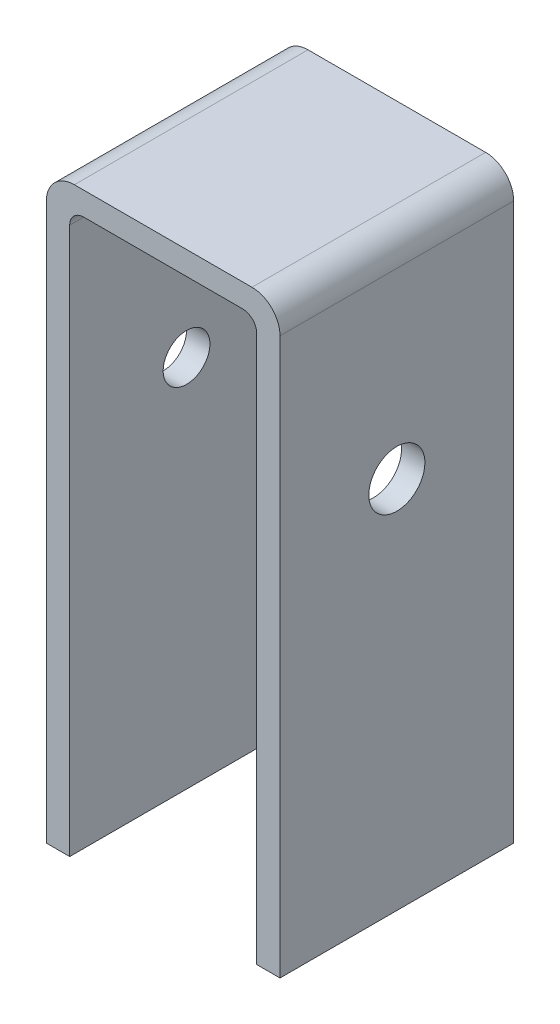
ISO-10303-21;
HEADER;
FILE_DESCRIPTION(('STEP AP214'),'2;1');
FILE_NAME('part.step','',(''),(''),'','','');
FILE_SCHEMA(('AUTOMOTIVE_DESIGN { 1 0 10303 214 1 1 1 1 }'));
ENDSEC;
DATA;
#1=APPLICATION_CONTEXT('core data for automotive mechanical design processes');
#2=APPLICATION_PROTOCOL_DEFINITION('international standard','automotive_design',2000,#1);
#3=PRODUCT_CONTEXT('',#1,'mechanical');
#4=PRODUCT('Part','Part','',(#3));
#5=PRODUCT_RELATED_PRODUCT_CATEGORY('part','',(#4));
#6=PRODUCT_DEFINITION_FORMATION('','',#4);
#7=PRODUCT_DEFINITION_CONTEXT('part definition',#1,'design');
#8=PRODUCT_DEFINITION('design','',#6,#7);
#9=PRODUCT_DEFINITION_SHAPE('','',#8);
#10=(LENGTH_UNIT() NAMED_UNIT(*) SI_UNIT(.MILLI.,.METRE.));
#11=(NAMED_UNIT(*) PLANE_ANGLE_UNIT() SI_UNIT($,.RADIAN.));
#12=(NAMED_UNIT(*) SI_UNIT($,.STERADIAN.) SOLID_ANGLE_UNIT());
#13=UNCERTAINTY_MEASURE_WITH_UNIT(LENGTH_MEASURE(1.E-05),#10,'distance_accuracy_value','');
#14=(GEOMETRIC_REPRESENTATION_CONTEXT(3) GLOBAL_UNCERTAINTY_ASSIGNED_CONTEXT((#13)) GLOBAL_UNIT_ASSIGNED_CONTEXT((#10,
#11,#12)) REPRESENTATION_CONTEXT('',''));
#15=CARTESIAN_POINT('',(0.,0.,0.));
#16=DIRECTION('',(0.,0.,1.));
#17=DIRECTION('',(1.,0.,0.));
#18=AXIS2_PLACEMENT_3D('',#15,#16,#17);
#19=CARTESIAN_POINT('',(0.,119.,50.));
#20=DIRECTION('',(1.,0.,0.));
#21=DIRECTION('',(0.,1.,0.));
#22=AXIS2_PLACEMENT_3D('',#19,#20,#21);
#23=PLANE('',#22);
#24=CARTESIAN_POINT('',(0.,80.,25.));
#25=DIRECTION('',(1.,0.,0.));
#26=DIRECTION('',(0.,1.,0.));
#27=AXIS2_PLACEMENT_3D('',#24,#25,#26);
#28=CIRCLE('',#27,4.99999999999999);
#29=CARTESIAN_POINT('',(0.,85.,25.));
#30=VERTEX_POINT('',#29);
#31=EDGE_CURVE('E265',#30,#30,#28,.T.);
#32=ORIENTED_EDGE('',*,*,#31,.T.);
#33=EDGE_LOOP('',(#32));
#34=FACE_BOUND('',#33,.T.);
#35=DIRECTION('',(0.,-1.,0.));
#36=VECTOR('',#35,1.);
#37=CARTESIAN_POINT('',(0.,119.,0.));
#38=LINE('',#37,#36);
#39=CARTESIAN_POINT('',(0.,119.,0.));
#40=VERTEX_POINT('',#39);
#41=CARTESIAN_POINT('',(0.,0.,0.));
#42=VERTEX_POINT('',#41);
#43=EDGE_CURVE('E116',#40,#42,#38,.T.);
#44=ORIENTED_EDGE('',*,*,#43,.T.);
#45=DIRECTION('',(0.,0.,-1.));
#46=VECTOR('',#45,1.);
#47=CARTESIAN_POINT('',(0.,0.,50.));
#48=LINE('',#47,#46);
#49=CARTESIAN_POINT('',(0.,0.,50.));
#50=VERTEX_POINT('',#49);
#51=EDGE_CURVE('E11',#50,#42,#48,.T.);
#52=ORIENTED_EDGE('',*,*,#51,.F.);
#53=DIRECTION('',(0.,-1.,0.));
#54=VECTOR('',#53,1.);
#55=CARTESIAN_POINT('',(0.,119.,50.));
#56=LINE('',#55,#54);
#57=CARTESIAN_POINT('',(0.,119.,50.));
#58=VERTEX_POINT('',#57);
#59=EDGE_CURVE('E156',#58,#50,#56,.T.);
#60=ORIENTED_EDGE('',*,*,#59,.F.);
#61=DIRECTION('',(0.,0.,-1.));
#62=VECTOR('',#61,1.);
#63=CARTESIAN_POINT('',(0.,119.,50.));
#64=LINE('',#63,#62);
#65=EDGE_CURVE('E129',#58,#40,#64,.T.);
#66=ORIENTED_EDGE('',*,*,#65,.T.);
#67=EDGE_LOOP('',(#44,#52,#60,#66));
#68=FACE_BOUND('',#67,.T.);
#69=ADVANCED_FACE('F24',(#34,#68),#23,.F.);
#70=CARTESIAN_POINT('',(0.,0.,50.));
#71=DIRECTION('',(0.,1.,0.));
#72=DIRECTION('',(0.,0.,1.));
#73=AXIS2_PLACEMENT_3D('',#70,#71,#72);
#74=PLANE('',#73);
#75=DIRECTION('',(1.,0.,0.));
#76=VECTOR('',#75,1.);
#77=CARTESIAN_POINT('',(0.,0.,0.));
#78=LINE('',#77,#76);
#79=CARTESIAN_POINT('',(5.,0.,0.));
#80=VERTEX_POINT('',#79);
#81=EDGE_CURVE('E112',#42,#80,#78,.T.);
#82=ORIENTED_EDGE('',*,*,#81,.T.);
#83=DIRECTION('',(0.,0.,-1.));
#84=VECTOR('',#83,1.);
#85=CARTESIAN_POINT('',(5.,0.,50.));
#86=LINE('',#85,#84);
#87=CARTESIAN_POINT('',(5.,0.,50.));
#88=VERTEX_POINT('',#87);
#89=EDGE_CURVE('E31',#88,#80,#86,.T.);
#90=ORIENTED_EDGE('',*,*,#89,.F.);
#91=DIRECTION('',(1.,0.,0.));
#92=VECTOR('',#91,1.);
#93=CARTESIAN_POINT('',(0.,0.,50.));
#94=LINE('',#93,#92);
#95=EDGE_CURVE('E125',#50,#88,#94,.T.);
#96=ORIENTED_EDGE('',*,*,#95,.F.);
#97=ORIENTED_EDGE('',*,*,#51,.T.);
#98=EDGE_LOOP('',(#82,#90,#96,#97));
#99=FACE_BOUND('',#98,.T.);
#100=ADVANCED_FACE('F124',(#99),#74,.F.);
#101=CARTESIAN_POINT('',(5.,0.,50.));
#102=DIRECTION('',(-1.,0.,0.));
#103=DIRECTION('',(0.,0.,1.));
#104=AXIS2_PLACEMENT_3D('',#101,#102,#103);
#105=PLANE('',#104);
#106=CARTESIAN_POINT('',(5.,80.,25.));
#107=DIRECTION('',(1.,0.,0.));
#108=DIRECTION('',(0.,0.,-1.));
#109=AXIS2_PLACEMENT_3D('',#106,#107,#108);
#110=CIRCLE('',#109,4.99999999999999);
#111=CARTESIAN_POINT('',(5.,80.,20.));
#112=VERTEX_POINT('',#111);
#113=EDGE_CURVE('E267',#112,#112,#110,.T.);
#114=ORIENTED_EDGE('',*,*,#113,.F.);
#115=EDGE_LOOP('',(#114));
#116=FACE_BOUND('',#115,.T.);
#117=DIRECTION('',(0.,1.,0.));
#118=VECTOR('',#117,1.);
#119=CARTESIAN_POINT('',(5.,0.,0.));
#120=LINE('',#119,#118);
#121=CARTESIAN_POINT('',(5.,117.,0.));
#122=VERTEX_POINT('',#121);
#123=EDGE_CURVE('E118',#80,#122,#120,.T.);
#124=ORIENTED_EDGE('',*,*,#123,.T.);
#125=DIRECTION('',(0.,0.,-1.));
#126=VECTOR('',#125,1.);
#127=CARTESIAN_POINT('',(5.,117.,50.));
#128=LINE('',#127,#126);
#129=CARTESIAN_POINT('',(5.,117.,50.));
#130=VERTEX_POINT('',#129);
#131=EDGE_CURVE('E202',#130,#122,#128,.T.);
#132=ORIENTED_EDGE('',*,*,#131,.F.);
#133=DIRECTION('',(0.,1.,0.));
#134=VECTOR('',#133,1.);
#135=CARTESIAN_POINT('',(5.,0.,50.));
#136=LINE('',#135,#134);
#137=EDGE_CURVE('E159',#88,#130,#136,.T.);
#138=ORIENTED_EDGE('',*,*,#137,.F.);
#139=ORIENTED_EDGE('',*,*,#89,.T.);
#140=EDGE_LOOP('',(#124,#132,#138,#139));
#141=FACE_BOUND('',#140,.T.);
#142=ADVANCED_FACE('F206',(#116,#141),#105,.F.);
#143=CARTESIAN_POINT('',(8.,117.,50.));
#144=DIRECTION('',(0.,0.,-1.));
#145=DIRECTION('',(-1.,0.,0.));
#146=AXIS2_PLACEMENT_3D('',#143,#144,#145);
#147=CYLINDRICAL_SURFACE('',#146,3.);
#148=CARTESIAN_POINT('',(8.,117.,0.));
#149=DIRECTION('',(0.,0.,-1.));
#150=DIRECTION('',(1.,0.,0.));
#151=AXIS2_PLACEMENT_3D('',#148,#149,#150);
#152=CIRCLE('',#151,3.);
#153=CARTESIAN_POINT('',(8.00000000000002,120.,0.));
#154=VERTEX_POINT('',#153);
#155=EDGE_CURVE('E138',#122,#154,#152,.T.);
#156=ORIENTED_EDGE('',*,*,#155,.T.);
#157=DIRECTION('',(0.,0.,-1.));
#158=VECTOR('',#157,1.);
#159=CARTESIAN_POINT('',(8.00000000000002,120.,50.));
#160=LINE('',#159,#158);
#161=CARTESIAN_POINT('',(8.00000000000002,120.,50.));
#162=VERTEX_POINT('',#161);
#163=EDGE_CURVE('E199',#162,#154,#160,.T.);
#164=ORIENTED_EDGE('',*,*,#163,.F.);
#165=CARTESIAN_POINT('',(8.,117.,50.));
#166=DIRECTION('',(0.,0.,-1.));
#167=DIRECTION('',(1.,0.,0.));
#168=AXIS2_PLACEMENT_3D('',#165,#166,#167);
#169=CIRCLE('',#168,3.);
#170=EDGE_CURVE('E161',#130,#162,#169,.T.);
#171=ORIENTED_EDGE('',*,*,#170,.F.);
#172=ORIENTED_EDGE('',*,*,#131,.T.);
#173=EDGE_LOOP('',(#156,#164,#171,#172));
#174=FACE_BOUND('',#173,.T.);
#175=ADVANCED_FACE('F214',(#174),#147,.F.);
#176=CARTESIAN_POINT('',(8.00000000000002,120.,50.));
#177=DIRECTION('',(0.,1.,0.));
#178=DIRECTION('',(0.,0.,1.));
#179=AXIS2_PLACEMENT_3D('',#176,#177,#178);
#180=PLANE('',#179);
#181=DIRECTION('',(1.,0.,0.));
#182=VECTOR('',#181,1.);
#183=CARTESIAN_POINT('',(8.00000000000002,120.,0.));
#184=LINE('',#183,#182);
#185=CARTESIAN_POINT('',(42.,120.,0.));
#186=VERTEX_POINT('',#185);
#187=EDGE_CURVE('E140',#154,#186,#184,.T.);
#188=ORIENTED_EDGE('',*,*,#187,.T.);
#189=DIRECTION('',(0.,0.,-1.));
#190=VECTOR('',#189,1.);
#191=CARTESIAN_POINT('',(42.,120.,50.));
#192=LINE('',#191,#190);
#193=CARTESIAN_POINT('',(42.,120.,50.));
#194=VERTEX_POINT('',#193);
#195=EDGE_CURVE('E196',#194,#186,#192,.T.);
#196=ORIENTED_EDGE('',*,*,#195,.F.);
#197=DIRECTION('',(1.,0.,0.));
#198=VECTOR('',#197,1.);
#199=CARTESIAN_POINT('',(8.00000000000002,120.,50.));
#200=LINE('',#199,#198);
#201=EDGE_CURVE('E163',#162,#194,#200,.T.);
#202=ORIENTED_EDGE('',*,*,#201,.F.);
#203=ORIENTED_EDGE('',*,*,#163,.T.);
#204=EDGE_LOOP('',(#188,#196,#202,#203));
#205=FACE_BOUND('',#204,.T.);
#206=ADVANCED_FACE('F217',(#205),#180,.F.);
#207=CARTESIAN_POINT('',(42.,117.,50.));
#208=DIRECTION('',(0.,0.,-1.));
#209=DIRECTION('',(-1.,0.,0.));
#210=AXIS2_PLACEMENT_3D('',#207,#208,#209);
#211=CYLINDRICAL_SURFACE('',#210,3.);
#212=CARTESIAN_POINT('',(42.,117.,0.));
#213=DIRECTION('',(0.,0.,-1.));
#214=DIRECTION('',(1.,0.,0.));
#215=AXIS2_PLACEMENT_3D('',#212,#213,#214);
#216=CIRCLE('',#215,3.);
#217=CARTESIAN_POINT('',(45.,117.,0.));
#218=VERTEX_POINT('',#217);
#219=EDGE_CURVE('E142',#186,#218,#216,.T.);
#220=ORIENTED_EDGE('',*,*,#219,.T.);
#221=DIRECTION('',(0.,0.,-1.));
#222=VECTOR('',#221,1.);
#223=CARTESIAN_POINT('',(45.,117.,50.));
#224=LINE('',#223,#222);
#225=CARTESIAN_POINT('',(45.,117.,50.));
#226=VERTEX_POINT('',#225);
#227=EDGE_CURVE('E193',#226,#218,#224,.T.);
#228=ORIENTED_EDGE('',*,*,#227,.F.);
#229=CARTESIAN_POINT('',(42.,117.,50.));
#230=DIRECTION('',(0.,0.,-1.));
#231=DIRECTION('',(1.,0.,0.));
#232=AXIS2_PLACEMENT_3D('',#229,#230,#231);
#233=CIRCLE('',#232,3.);
#234=EDGE_CURVE('E165',#194,#226,#233,.T.);
#235=ORIENTED_EDGE('',*,*,#234,.F.);
#236=ORIENTED_EDGE('',*,*,#195,.T.);
#237=EDGE_LOOP('',(#220,#228,#235,#236));
#238=FACE_BOUND('',#237,.T.);
#239=ADVANCED_FACE('F222',(#238),#211,.F.);
#240=CARTESIAN_POINT('',(45.,117.,50.));
#241=DIRECTION('',(1.,0.,0.));
#242=DIRECTION('',(0.,1.,0.));
#243=AXIS2_PLACEMENT_3D('',#240,#241,#242);
#244=PLANE('',#243);
#245=CARTESIAN_POINT('',(45.,80.,25.));
#246=DIRECTION('',(1.,0.,0.));
#247=DIRECTION('',(0.,1.,0.));
#248=AXIS2_PLACEMENT_3D('',#245,#246,#247);
#249=CIRCLE('',#248,6.);
#250=CARTESIAN_POINT('',(45.,86.,25.));
#251=VERTEX_POINT('',#250);
#252=EDGE_CURVE('E130',#251,#251,#249,.T.);
#253=ORIENTED_EDGE('',*,*,#252,.T.);
#254=EDGE_LOOP('',(#253));
#255=FACE_BOUND('',#254,.T.);
#256=DIRECTION('',(0.,-1.,0.));
#257=VECTOR('',#256,1.);
#258=CARTESIAN_POINT('',(45.,117.,0.));
#259=LINE('',#258,#257);
#260=CARTESIAN_POINT('',(45.,0.,0.));
#261=VERTEX_POINT('',#260);
#262=EDGE_CURVE('E144',#218,#261,#259,.T.);
#263=ORIENTED_EDGE('',*,*,#262,.T.);
#264=DIRECTION('',(0.,0.,-1.));
#265=VECTOR('',#264,1.);
#266=CARTESIAN_POINT('',(45.,0.,50.));
#267=LINE('',#266,#265);
#268=CARTESIAN_POINT('',(45.,0.,50.));
#269=VERTEX_POINT('',#268);
#270=EDGE_CURVE('E190',#269,#261,#267,.T.);
#271=ORIENTED_EDGE('',*,*,#270,.F.);
#272=DIRECTION('',(0.,-1.,0.));
#273=VECTOR('',#272,1.);
#274=CARTESIAN_POINT('',(45.,117.,50.));
#275=LINE('',#274,#273);
#276=EDGE_CURVE('E167',#226,#269,#275,.T.);
#277=ORIENTED_EDGE('',*,*,#276,.F.);
#278=ORIENTED_EDGE('',*,*,#227,.T.);
#279=EDGE_LOOP('',(#263,#271,#277,#278));
#280=FACE_BOUND('',#279,.T.);
#281=ADVANCED_FACE('F228',(#255,#280),#244,.F.);
#282=CARTESIAN_POINT('',(45.,0.,50.));
#283=DIRECTION('',(0.,1.,0.));
#284=DIRECTION('',(-1.,0.,0.));
#285=AXIS2_PLACEMENT_3D('',#282,#283,#284);
#286=PLANE('',#285);
#287=DIRECTION('',(1.,0.,0.));
#288=VECTOR('',#287,1.);
#289=CARTESIAN_POINT('',(45.,0.,0.));
#290=LINE('',#289,#288);
#291=CARTESIAN_POINT('',(50.,0.,0.));
#292=VERTEX_POINT('',#291);
#293=EDGE_CURVE('E146',#261,#292,#290,.T.);
#294=ORIENTED_EDGE('',*,*,#293,.T.);
#295=DIRECTION('',(0.,0.,-1.));
#296=VECTOR('',#295,1.);
#297=CARTESIAN_POINT('',(50.,0.,50.));
#298=LINE('',#297,#296);
#299=CARTESIAN_POINT('',(50.,0.,50.));
#300=VERTEX_POINT('',#299);
#301=EDGE_CURVE('E187',#300,#292,#298,.T.);
#302=ORIENTED_EDGE('',*,*,#301,.F.);
#303=DIRECTION('',(1.,0.,0.));
#304=VECTOR('',#303,1.);
#305=CARTESIAN_POINT('',(45.,0.,50.));
#306=LINE('',#305,#304);
#307=EDGE_CURVE('E169',#269,#300,#306,.T.);
#308=ORIENTED_EDGE('',*,*,#307,.F.);
#309=ORIENTED_EDGE('',*,*,#270,.T.);
#310=EDGE_LOOP('',(#294,#302,#308,#309));
#311=FACE_BOUND('',#310,.T.);
#312=ADVANCED_FACE('F232',(#311),#286,.F.);
#313=CARTESIAN_POINT('',(50.,0.,50.));
#314=DIRECTION('',(-1.,0.,0.));
#315=DIRECTION('',(0.,-1.,0.));
#316=AXIS2_PLACEMENT_3D('',#313,#314,#315);
#317=PLANE('',#316);
#318=CARTESIAN_POINT('',(50.,80.,25.));
#319=DIRECTION('',(1.,0.,0.));
#320=DIRECTION('',(0.,1.,0.));
#321=AXIS2_PLACEMENT_3D('',#318,#319,#320);
#322=CIRCLE('',#321,6.);
#323=CARTESIAN_POINT('',(50.,86.,25.));
#324=VERTEX_POINT('',#323);
#325=EDGE_CURVE('E133',#324,#324,#322,.T.);
#326=ORIENTED_EDGE('',*,*,#325,.F.);
#327=EDGE_LOOP('',(#326));
#328=FACE_BOUND('',#327,.T.);
#329=DIRECTION('',(0.,1.,0.));
#330=VECTOR('',#329,1.);
#331=CARTESIAN_POINT('',(50.,0.,0.));
#332=LINE('',#331,#330);
#333=CARTESIAN_POINT('',(50.,119.,0.));
#334=VERTEX_POINT('',#333);
#335=EDGE_CURVE('E148',#292,#334,#332,.T.);
#336=ORIENTED_EDGE('',*,*,#335,.T.);
#337=DIRECTION('',(0.,0.,-1.));
#338=VECTOR('',#337,1.);
#339=CARTESIAN_POINT('',(50.,119.,50.));
#340=LINE('',#339,#338);
#341=CARTESIAN_POINT('',(50.,119.,50.));
#342=VERTEX_POINT('',#341);
#343=EDGE_CURVE('E184',#342,#334,#340,.T.);
#344=ORIENTED_EDGE('',*,*,#343,.F.);
#345=DIRECTION('',(0.,1.,0.));
#346=VECTOR('',#345,1.);
#347=CARTESIAN_POINT('',(50.,0.,50.));
#348=LINE('',#347,#346);
#349=EDGE_CURVE('E171',#300,#342,#348,.T.);
#350=ORIENTED_EDGE('',*,*,#349,.F.);
#351=ORIENTED_EDGE('',*,*,#301,.T.);
#352=EDGE_LOOP('',(#336,#344,#350,#351));
#353=FACE_BOUND('',#352,.T.);
#354=ADVANCED_FACE('F237',(#328,#353),#317,.F.);
#355=CARTESIAN_POINT('',(44.,119.,50.));
#356=DIRECTION('',(0.,0.,-1.));
#357=DIRECTION('',(-1.,0.,0.));
#358=AXIS2_PLACEMENT_3D('',#355,#356,#357);
#359=CYLINDRICAL_SURFACE('',#358,6.);
#360=CARTESIAN_POINT('',(44.,119.,0.));
#361=DIRECTION('',(0.,0.,1.));
#362=DIRECTION('',(-1.,0.,0.));
#363=AXIS2_PLACEMENT_3D('',#360,#361,#362);
#364=CIRCLE('',#363,6.);
#365=CARTESIAN_POINT('',(44.,125.,0.));
#366=VERTEX_POINT('',#365);
#367=EDGE_CURVE('E150',#334,#366,#364,.T.);
#368=ORIENTED_EDGE('',*,*,#367,.T.);
#369=DIRECTION('',(0.,0.,-1.));
#370=VECTOR('',#369,1.);
#371=CARTESIAN_POINT('',(44.,125.,50.));
#372=LINE('',#371,#370);
#373=CARTESIAN_POINT('',(44.,125.,50.));
#374=VERTEX_POINT('',#373);
#375=EDGE_CURVE('E181',#374,#366,#372,.T.);
#376=ORIENTED_EDGE('',*,*,#375,.F.);
#377=CARTESIAN_POINT('',(44.,119.,50.));
#378=DIRECTION('',(0.,0.,1.));
#379=DIRECTION('',(-1.,0.,0.));
#380=AXIS2_PLACEMENT_3D('',#377,#378,#379);
#381=CIRCLE('',#380,6.);
#382=EDGE_CURVE('E173',#342,#374,#381,.T.);
#383=ORIENTED_EDGE('',*,*,#382,.F.);
#384=ORIENTED_EDGE('',*,*,#343,.T.);
#385=EDGE_LOOP('',(#368,#376,#383,#384));
#386=FACE_BOUND('',#385,.T.);
#387=ADVANCED_FACE('F241',(#386),#359,.T.);
#388=CARTESIAN_POINT('',(44.,125.,50.));
#389=DIRECTION('',(0.,-1.,0.));
#390=DIRECTION('',(0.,0.,-1.));
#391=AXIS2_PLACEMENT_3D('',#388,#389,#390);
#392=PLANE('',#391);
#393=DIRECTION('',(-1.,0.,0.));
#394=VECTOR('',#393,1.);
#395=CARTESIAN_POINT('',(44.,125.,0.));
#396=LINE('',#395,#394);
#397=CARTESIAN_POINT('',(6.00000000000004,125.,0.));
#398=VERTEX_POINT('',#397);
#399=EDGE_CURVE('E152',#366,#398,#396,.T.);
#400=ORIENTED_EDGE('',*,*,#399,.T.);
#401=DIRECTION('',(0.,0.,-1.));
#402=VECTOR('',#401,1.);
#403=CARTESIAN_POINT('',(6.00000000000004,125.,50.));
#404=LINE('',#403,#402);
#405=CARTESIAN_POINT('',(6.00000000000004,125.,50.));
#406=VERTEX_POINT('',#405);
#407=EDGE_CURVE('E178',#406,#398,#404,.T.);
#408=ORIENTED_EDGE('',*,*,#407,.F.);
#409=DIRECTION('',(-1.,0.,0.));
#410=VECTOR('',#409,1.);
#411=CARTESIAN_POINT('',(44.,125.,50.));
#412=LINE('',#411,#410);
#413=EDGE_CURVE('E43',#374,#406,#412,.T.);
#414=ORIENTED_EDGE('',*,*,#413,.F.);
#415=ORIENTED_EDGE('',*,*,#375,.T.);
#416=EDGE_LOOP('',(#400,#408,#414,#415));
#417=FACE_BOUND('',#416,.T.);
#418=ADVANCED_FACE('F245',(#417),#392,.F.);
#419=CARTESIAN_POINT('',(6.,119.,50.));
#420=DIRECTION('',(0.,0.,-1.));
#421=DIRECTION('',(-1.,0.,0.));
#422=AXIS2_PLACEMENT_3D('',#419,#420,#421);
#423=CYLINDRICAL_SURFACE('',#422,6.);
#424=CARTESIAN_POINT('',(6.,119.,0.));
#425=DIRECTION('',(0.,0.,1.));
#426=DIRECTION('',(1.,0.,0.));
#427=AXIS2_PLACEMENT_3D('',#424,#425,#426);
#428=CIRCLE('',#427,6.);
#429=EDGE_CURVE('E154',#398,#40,#428,.T.);
#430=ORIENTED_EDGE('',*,*,#429,.T.);
#431=ORIENTED_EDGE('',*,*,#65,.F.);
#432=CARTESIAN_POINT('',(6.,119.,50.));
#433=DIRECTION('',(0.,0.,1.));
#434=DIRECTION('',(1.,0.,0.));
#435=AXIS2_PLACEMENT_3D('',#432,#433,#434);
#436=CIRCLE('',#435,6.);
#437=EDGE_CURVE('E38',#406,#58,#436,.T.);
#438=ORIENTED_EDGE('',*,*,#437,.F.);
#439=ORIENTED_EDGE('',*,*,#407,.T.);
#440=EDGE_LOOP('',(#430,#431,#438,#439));
#441=FACE_BOUND('',#440,.T.);
#442=ADVANCED_FACE('F247',(#441),#423,.T.);
#443=CARTESIAN_POINT('',(8.,117.,50.));
#444=DIRECTION('',(0.,0.,1.));
#445=DIRECTION('',(1.,0.,0.));
#446=AXIS2_PLACEMENT_3D('',#443,#444,#445);
#447=PLANE('',#446);
#448=ORIENTED_EDGE('',*,*,#59,.T.);
#449=ORIENTED_EDGE('',*,*,#95,.T.);
#450=ORIENTED_EDGE('',*,*,#137,.T.);
#451=ORIENTED_EDGE('',*,*,#170,.T.);
#452=ORIENTED_EDGE('',*,*,#201,.T.);
#453=ORIENTED_EDGE('',*,*,#234,.T.);
#454=ORIENTED_EDGE('',*,*,#276,.T.);
#455=ORIENTED_EDGE('',*,*,#307,.T.);
#456=ORIENTED_EDGE('',*,*,#349,.T.);
#457=ORIENTED_EDGE('',*,*,#382,.T.);
#458=ORIENTED_EDGE('',*,*,#413,.T.);
#459=ORIENTED_EDGE('',*,*,#437,.T.);
#460=EDGE_LOOP('',(#448,#449,#450,#451,#452,#453,#454,#455,#456,#457,#458,#459));
#461=FACE_BOUND('',#460,.T.);
#462=ADVANCED_FACE('F209',(#461),#447,.T.);
#463=CARTESIAN_POINT('',(8.,117.,0.));
#464=DIRECTION('',(0.,0.,1.));
#465=DIRECTION('',(1.,0.,0.));
#466=AXIS2_PLACEMENT_3D('',#463,#464,#465);
#467=PLANE('',#466);
#468=ORIENTED_EDGE('',*,*,#43,.F.);
#469=ORIENTED_EDGE('',*,*,#429,.F.);
#470=ORIENTED_EDGE('',*,*,#399,.F.);
#471=ORIENTED_EDGE('',*,*,#367,.F.);
#472=ORIENTED_EDGE('',*,*,#335,.F.);
#473=ORIENTED_EDGE('',*,*,#293,.F.);
#474=ORIENTED_EDGE('',*,*,#262,.F.);
#475=ORIENTED_EDGE('',*,*,#219,.F.);
#476=ORIENTED_EDGE('',*,*,#187,.F.);
#477=ORIENTED_EDGE('',*,*,#155,.F.);
#478=ORIENTED_EDGE('',*,*,#123,.F.);
#479=ORIENTED_EDGE('',*,*,#81,.F.);
#480=EDGE_LOOP('',(#468,#469,#470,#471,#472,#473,#474,#475,#476,#477,#478,#479));
#481=FACE_BOUND('',#480,.T.);
#482=ADVANCED_FACE('F113',(#481),#467,.F.);
#483=CARTESIAN_POINT('',(45.,80.,25.));
#484=DIRECTION('',(1.,0.,0.));
#485=DIRECTION('',(0.,1.,0.));
#486=AXIS2_PLACEMENT_3D('',#483,#484,#485);
#487=CYLINDRICAL_SURFACE('',#486,6.);
#488=ORIENTED_EDGE('',*,*,#252,.F.);
#489=EDGE_LOOP('',(#488));
#490=FACE_BOUND('',#489,.T.);
#491=ORIENTED_EDGE('',*,*,#325,.T.);
#492=EDGE_LOOP('',(#491));
#493=FACE_BOUND('',#492,.T.);
#494=ADVANCED_FACE('F318',(#490,#493),#487,.F.);
#495=CARTESIAN_POINT('',(5.,80.,25.));
#496=DIRECTION('',(1.,0.,0.));
#497=DIRECTION('',(0.,0.,-1.));
#498=AXIS2_PLACEMENT_3D('',#495,#496,#497);
#499=CYLINDRICAL_SURFACE('',#498,4.99999999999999);
#500=ORIENTED_EDGE('',*,*,#113,.T.);
#501=EDGE_LOOP('',(#500));
#502=FACE_BOUND('',#501,.T.);
#503=ORIENTED_EDGE('',*,*,#31,.F.);
#504=EDGE_LOOP('',(#503));
#505=FACE_BOUND('',#504,.T.);
#506=ADVANCED_FACE('F274',(#502,#505),#499,.F.);
#507=CLOSED_SHELL('',(#69,#100,#142,#175,#206,#239,#281,#312,#354,#387,#418,#442,#462,#482,#494,#506));
#508=MANIFOLD_SOLID_BREP('B2',#507);
#509=ADVANCED_BREP_SHAPE_REPRESENTATION('',(#18,#508),#14);
#510=SHAPE_DEFINITION_REPRESENTATION(#9,#509);
ENDSEC;
END-ISO-10303-21;
